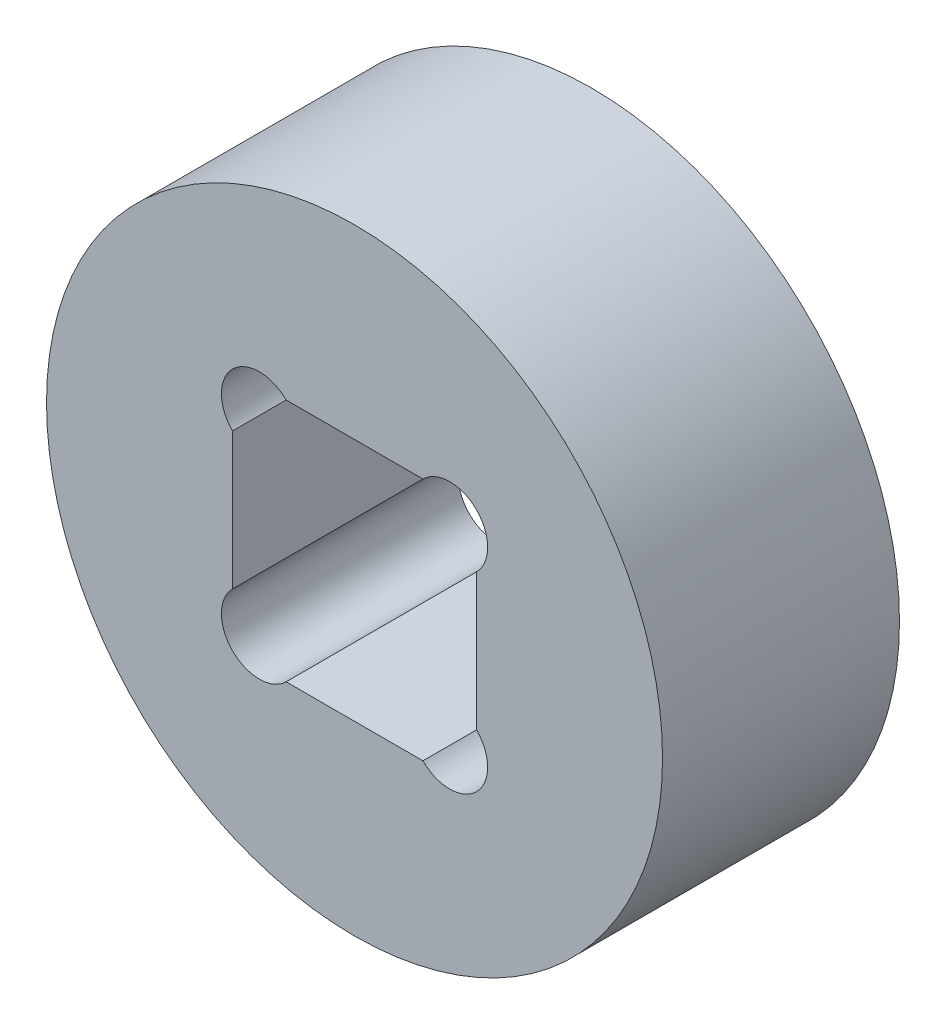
from build123d import *

# Parameters (mm, degrees)
ESQUISSE1_R             = 13
BOSS_EXTRU_1_DEPTH      = 10
ENL_V_MAT_EXTRU_1_DEPTH = 21.928449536


with BuildPart() as part:
    # Esquisse1 → Boss.-Extru.1 (new body)
    with BuildSketch(Plane.XY):
        Circle(ESQUISSE1_R)
    extrude(amount=BOSS_EXTRU_1_DEPTH)

    # Esquisse2 → Enl_v. mat.-Extru.1 (cut, through all)
    with BuildSketch(Plane.XY.offset(10)):
        with BuildLine():
            Line((-2.8872583, 5.15), (2.8872583, 5.15))
            ThreePointArc((2.8872583, 5.15), (5.15, 5.15), (5.15, 2.8872583))
            Line((5.15, 2.8872583), (5.15, -2.8872583))
            ThreePointArc((5.15, -2.8872583), (5.15, -5.15), (2.8872583, -5.15))
            Line((2.8872583, -5.15), (-2.8872583, -5.15))
            ThreePointArc((-2.8872583, -5.15), (-5.15, -5.15), (-5.15, -2.8872583))
            Line((-5.15, -2.8872583), (-5.15, 2.8872583))
            ThreePointArc((-5.15, 2.8872583), (-5.15, 5.15), (-2.8872583, 5.15))
        make_face()
    extrude(amount=-ENL_V_MAT_EXTRU_1_DEPTH, mode=Mode.SUBTRACT)


solid = part.part
